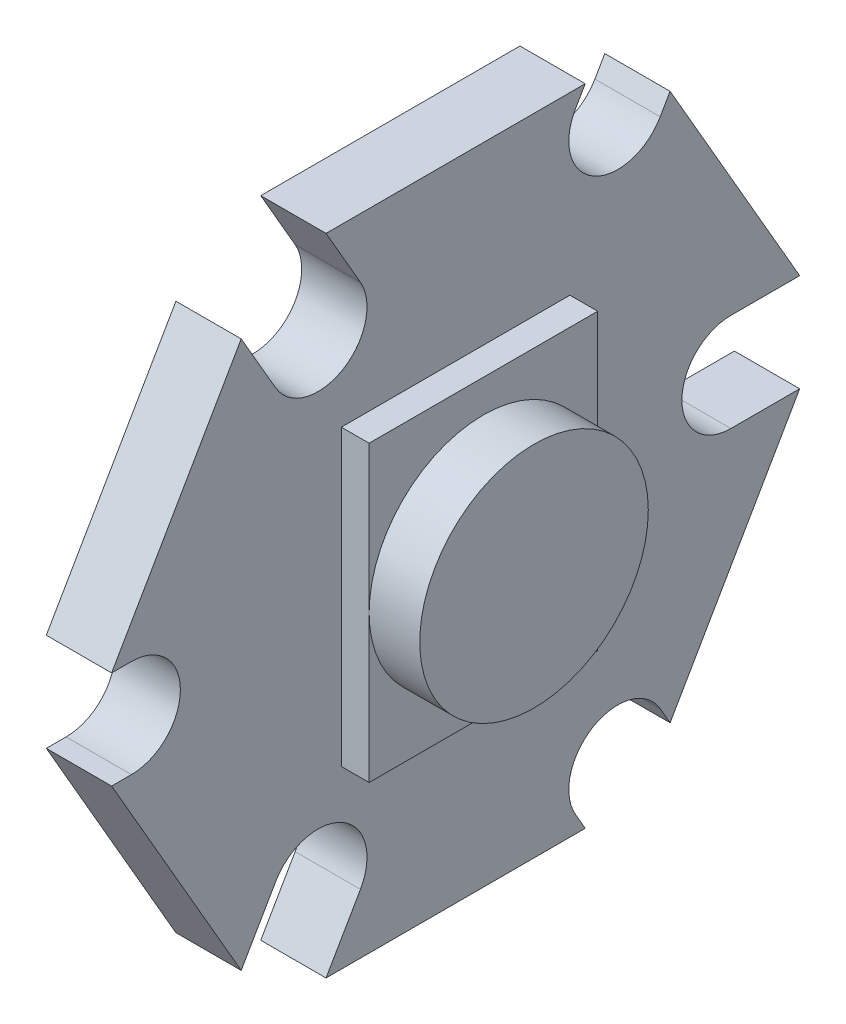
from build123d import *

# Parameters (mm, degrees)
BOSS_EXTRUDE1_DEPTH = 1
CUT_EXTRUDE2_DEPTH  = 16.216322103
CUT_EXTRUDE3_DEPTH  = 16.216322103
SKETCH5_W           = 7
SKETCH5_H           = 9
BOSS_EXTRUDE2_DEPTH = 0.85
SKETCH7_R           = 3.5
BOSS_EXTRUDE3_DEPTH = 1.55


with BuildPart() as part:
    # Sketch1 → Boss-Extrude1 (new, symmetric)
    with BuildSketch(Plane(origin=(0, 0, 0), x_dir=(0, 0, -1), z_dir=(1, 0, 0))):
        Polygon((5.701333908, 9.875), (-5.701333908, 9.875), (-11.402667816, 0), (-5.701333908, -9.875), (5.701333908, -9.875), (11.402667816, 0), align=None)
    extrude(amount=BOSS_EXTRUDE1_DEPTH, both=True)

    # Sketch2 → Cut-Extrude2 (cut, through all)
    with BuildSketch(Plane(origin=(1, 0, 0), x_dir=(0, 0, -1), z_dir=(1, 0, 0))):
        with BuildLine():
            Line((8.42931393, 1.5), (11.935184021, 1.5))
            ThreePointArc((11.935184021, 1.5), (13.435184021, 0), (11.935184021, -1.5))
            Line((11.935184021, -1.5), (8.42931393, -1.5))
            ThreePointArc((8.42931393, -1.5), (6.92931393, 0), (8.42931393, 1.5))
        make_face()
        with BuildLine():
            Line((-5.513695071, 6.55), (-7.599312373, 10.162395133))
            ThreePointArc((-7.599312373, 10.162395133), (-7.050274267, 12.211433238), (-5.001236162, 11.662395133))
            Line((-5.001236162, 11.662395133), (-2.915618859, 8.05))
            ThreePointArc((-2.915618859, 8.05), (-3.464656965, 6.000961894), (-5.513695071, 6.55))
        make_face()
        with BuildLine():
            Line((-2.915618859, -8.05), (-5.034471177, -11.719959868))
            ThreePointArc((-5.034471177, -11.719959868), (-7.083509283, -12.268997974), (-7.632547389, -10.219959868))
            Line((-7.632547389, -10.219959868), (-5.513695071, -6.55))
            ThreePointArc((-5.513695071, -6.55), (-3.464656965, -6.000961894), (-2.915618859, -8.05))
        make_face()
    extrude(amount=-CUT_EXTRUDE2_DEPTH, mode=Mode.SUBTRACT)

    # Sketch4 → Cut-Extrude3 (cut, through all)
    with BuildSketch(Plane(origin=(1, 0, 0), x_dir=(0, 0, -1), z_dir=(1, 0, 0))):
        with BuildLine():
            Line((-9.93042463, -1.5), (-12.93042463, -1.5))
            ThreePointArc((-12.93042463, -1.5), (-14.43042463, 0), (-12.93042463, 1.5))
            Line((-12.93042463, 1.5), (-9.93042463, 1.5))
            ThreePointArc((-9.93042463, 1.5), (-8.43042463, 0), (-9.93042463, -1.5))
        make_face()
        with BuildLine():
            Line((3.666174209, 9.35), (5.166174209, 11.948076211))
            ThreePointArc((5.166174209, 11.948076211), (7.215212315, 12.497114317), (7.764250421, 10.448076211))
            Line((7.764250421, 10.448076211), (6.264250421, 7.85))
            ThreePointArc((6.264250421, 7.85), (4.215212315, 7.300961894), (3.666174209, 9.35))
        make_face()
        with BuildLine():
            Line((6.264250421, -7.85), (7.764250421, -10.448076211))
            ThreePointArc((7.764250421, -10.448076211), (7.215212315, -12.497114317), (5.166174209, -11.948076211))
            Line((5.166174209, -11.948076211), (3.666174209, -9.35))
            ThreePointArc((3.666174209, -9.35), (4.215212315, -7.300961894), (6.264250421, -7.85))
        make_face()
    extrude(amount=-CUT_EXTRUDE3_DEPTH, mode=Mode.SUBTRACT)

    # Sketch5 → Boss-Extrude2 (add)
    with BuildSketch(Plane(origin=(1, 0, 0), x_dir=(0, 0, -1), z_dir=(1, 0, 0))):
        Rectangle(SKETCH5_W, SKETCH5_H)
    extrude(amount=BOSS_EXTRUDE2_DEPTH)

    # Sketch7 → Boss-Extrude3 (add)
    with BuildSketch(Plane(origin=(1.85, 0, 0), x_dir=(0, 0, -1), z_dir=(1, 0, 0))):
        Circle(SKETCH7_R)
    extrude(amount=BOSS_EXTRUDE3_DEPTH)


solid = part.part
